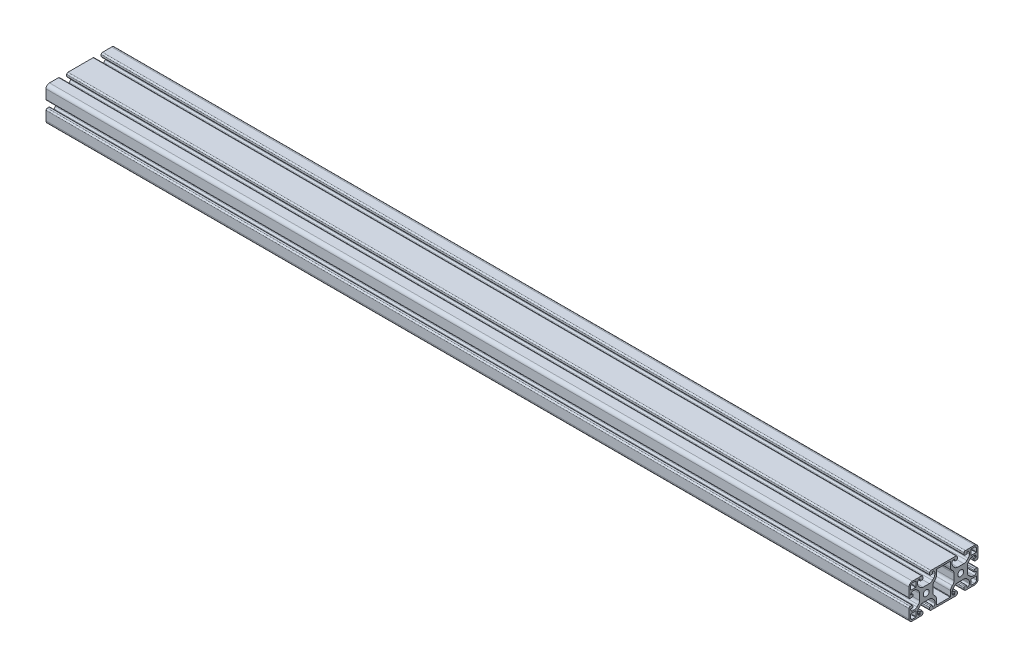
from build123d import *

# Parameters (mm, degrees)
MODEL_R                = 3.4
STRUKTURBAUTEIL1_DEPTH = 1000


with BuildPart() as part:
    # Model → Strukturbauteil1 (new body)
    with BuildSketch(Plane(origin=(0, 0, 0), x_dir=(0, 0, -1), z_dir=(1, 0, 0))):
        with BuildLine():
            Line((-39.999999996, -15.999999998), (-39.999999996, -5.499999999))
            ThreePointArc((-39.999999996, -5.499999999), (-39.560660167, -4.439339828), (-38.499999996, -4))
            Line((-38.499999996, -4), (-36.499999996, -4))
            ThreePointArc((-36.499999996, -4), (-35.792893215, -4.292893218), (-35.499999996, -4.999999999))
            Line((-35.499999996, -4.999999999), (-35.499999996, -6.499999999))
            ThreePointArc((-35.499999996, -6.499999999), (-35.646446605, -6.85355339), (-35.999999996, -6.999999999))
            Line((-35.999999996, -6.999999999), (-37.499999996, -6.999999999))
            Line((-37.499999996, -6.999999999), (-37.691341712, -7.038060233))
            Line((-37.691341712, -7.038060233), (-37.853553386, -7.146446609))
            Line((-37.853553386, -7.146446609), (-37.961939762, -7.308658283))
            Line((-37.961939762, -7.308658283), (-37.999999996, -7.499999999))
            ThreePointArc((-37.999999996, -7.499999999), (-37.267766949, -9.267766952), (-35.499999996, -9.999999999))
            Line((-35.499999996, -9.999999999), (-34.192388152, -9.999999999))
            ThreePointArc((-34.192388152, -9.999999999), (-32.27897099, -9.619397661), (-30.656854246, -8.535533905))
            Line((-30.656854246, -8.535533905), (-29.214466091, -7.09314575))
            ThreePointArc((-29.214466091, -7.09314575), (-28.130602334, -5.471029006), (-27.749999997, -3.557611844))
            Line((-27.749999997, -3.557611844), (-27.749999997, 3.557611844))
            ThreePointArc((-27.749999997, 3.557611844), (-28.130602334, 5.471029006), (-29.214466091, 7.09314575))
            Line((-29.214466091, 7.09314575), (-30.656854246, 8.535533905))
            ThreePointArc((-30.656854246, 8.535533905), (-32.27897099, 9.619397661), (-34.192388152, 9.999999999))
            Line((-34.192388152, 9.999999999), (-35.499999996, 9.999999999))
            ThreePointArc((-35.499999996, 9.999999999), (-37.267766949, 9.267766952), (-37.999999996, 7.499999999))
            Line((-37.999999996, 7.499999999), (-37.961939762, 7.308658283))
            Line((-37.961939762, 7.308658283), (-37.853553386, 7.146446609))
            Line((-37.853553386, 7.146446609), (-37.691341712, 7.038060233))
            Line((-37.691341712, 7.038060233), (-37.499999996, 6.999999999))
            Line((-37.499999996, 6.999999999), (-35.999999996, 6.999999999))
            ThreePointArc((-35.999999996, 6.999999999), (-35.646446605, 6.85355339), (-35.499999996, 6.499999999))
            Line((-35.499999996, 6.499999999), (-35.499999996, 4.999999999))
            ThreePointArc((-35.499999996, 4.999999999), (-35.792893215, 4.292893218), (-36.499999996, 4))
            Line((-36.499999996, 4), (-38.499999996, 4))
            ThreePointArc((-38.499999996, 4), (-39.560660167, 4.439339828), (-39.999999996, 5.499999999))
            Line((-39.999999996, 5.499999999), (-39.999999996, 15.999999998))
            ThreePointArc((-39.999999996, 15.999999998), (-38.82842712, 18.828427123), (-35.999999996, 19.999999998))
            Line((-35.999999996, 19.999999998), (-25.499999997, 19.999999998))
            ThreePointArc((-25.499999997, 19.999999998), (-24.439339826, 19.56066017), (-23.999999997, 18.499999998))
            Line((-23.999999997, 18.499999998), (-23.999999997, 16.499999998))
            ThreePointArc((-23.999999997, 16.499999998), (-24.292893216, 15.792893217), (-24.999999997, 15.499999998))
            Line((-24.999999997, 15.499999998), (-26.499999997, 15.499999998))
            ThreePointArc((-26.499999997, 15.499999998), (-26.853553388, 15.646446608), (-26.999999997, 15.999999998))
            Line((-26.999999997, 15.999999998), (-26.999999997, 17.499999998))
            Line((-26.999999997, 17.499999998), (-27.038060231, 17.691341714))
            Line((-27.038060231, 17.691341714), (-27.146446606, 17.853553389))
            Line((-27.146446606, 17.853553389), (-27.308658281, 17.961939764))
            Line((-27.308658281, 17.961939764), (-27.499999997, 17.999999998))
            ThreePointArc((-27.499999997, 17.999999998), (-29.26776695, 17.267766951), (-29.999999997, 15.499999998))
            Line((-29.999999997, 15.499999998), (-29.999999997, 14.192388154))
            ThreePointArc((-29.999999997, 14.192388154), (-29.619397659, 12.278970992), (-28.535533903, 10.656854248))
            Line((-28.535533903, 10.656854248), (-27.093145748, 9.214466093))
            ThreePointArc((-27.093145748, 9.214466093), (-25.471029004, 8.130602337), (-23.557611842, 7.749999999))
            Line((-23.557611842, 7.749999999), (-16.442388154, 7.749999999))
            ThreePointArc((-16.442388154, 7.749999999), (-14.528970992, 8.130602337), (-12.906854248, 9.214466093))
            Line((-12.906854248, 9.214466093), (-11.464466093, 10.656854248))
            ThreePointArc((-11.464466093, 10.656854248), (-10.380602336, 12.278970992), (-9.999999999, 14.192388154))
            Line((-9.999999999, 14.192388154), (-9.999999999, 15.499999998))
            ThreePointArc((-9.999999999, 15.499999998), (-10.732233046, 17.267766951), (-12.499999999, 17.999999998))
            Line((-12.499999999, 17.999999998), (-12.691341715, 17.961939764))
            Line((-12.691341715, 17.961939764), (-12.853553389, 17.853553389))
            Line((-12.853553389, 17.853553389), (-12.961939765, 17.691341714))
            Line((-12.961939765, 17.691341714), (-12.999999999, 17.499999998))
            Line((-12.999999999, 17.499999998), (-12.999999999, 15.999999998))
            ThreePointArc((-12.999999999, 15.999999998), (-13.146446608, 15.646446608), (-13.499999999, 15.499999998))
            Line((-13.499999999, 15.499999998), (-14.999999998, 15.499999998))
            ThreePointArc((-14.999999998, 15.499999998), (-15.707106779, 15.792893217), (-15.999999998, 16.499999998))
            Line((-15.999999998, 16.499999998), (-15.999999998, 18.499999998))
            ThreePointArc((-15.999999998, 18.499999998), (-15.56066017, 19.56066017), (-14.499999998, 19.999999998))
            Line((-14.499999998, 19.999999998), (14.499999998, 19.999999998))
            ThreePointArc((14.499999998, 19.999999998), (15.56066017, 19.56066017), (15.999999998, 18.499999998))
            Line((15.999999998, 18.499999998), (15.999999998, 16.499999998))
            ThreePointArc((15.999999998, 16.499999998), (15.707106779, 15.792893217), (14.999999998, 15.499999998))
            Line((14.999999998, 15.499999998), (13.499999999, 15.499999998))
            ThreePointArc((13.499999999, 15.499999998), (13.146446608, 15.646446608), (12.999999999, 15.999999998))
            Line((12.999999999, 15.999999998), (12.999999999, 17.499999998))
            Line((12.999999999, 17.499999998), (12.961939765, 17.691341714))
            Line((12.961939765, 17.691341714), (12.853553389, 17.853553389))
            Line((12.853553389, 17.853553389), (12.691341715, 17.961939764))
            Line((12.691341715, 17.961939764), (12.499999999, 17.999999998))
            ThreePointArc((12.499999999, 17.999999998), (10.732233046, 17.267766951), (9.999999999, 15.499999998))
            Line((9.999999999, 15.499999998), (9.999999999, 14.192388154))
            ThreePointArc((9.999999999, 14.192388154), (10.380602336, 12.278970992), (11.464466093, 10.656854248))
            Line((11.464466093, 10.656854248), (12.906854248, 9.214466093))
            ThreePointArc((12.906854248, 9.214466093), (14.528970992, 8.130602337), (16.442388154, 7.749999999))
            Line((16.442388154, 7.749999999), (23.557611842, 7.749999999))
            ThreePointArc((23.557611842, 7.749999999), (25.471029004, 8.130602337), (27.093145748, 9.214466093))
            Line((27.093145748, 9.214466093), (28.535533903, 10.656854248))
            ThreePointArc((28.535533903, 10.656854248), (29.619397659, 12.278970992), (29.999999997, 14.192388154))
            Line((29.999999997, 14.192388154), (29.999999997, 15.499999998))
            ThreePointArc((29.999999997, 15.499999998), (29.26776695, 17.267766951), (27.499999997, 17.999999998))
            Line((27.499999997, 17.999999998), (27.308658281, 17.961939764))
            Line((27.308658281, 17.961939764), (27.146446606, 17.853553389))
            Line((27.146446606, 17.853553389), (27.038060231, 17.691341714))
            Line((27.038060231, 17.691341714), (26.999999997, 17.499999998))
            Line((26.999999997, 17.499999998), (26.999999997, 15.999999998))
            ThreePointArc((26.999999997, 15.999999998), (26.853553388, 15.646446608), (26.499999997, 15.499999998))
            Line((26.499999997, 15.499999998), (24.999999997, 15.499999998))
            ThreePointArc((24.999999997, 15.499999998), (24.292893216, 15.792893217), (23.999999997, 16.499999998))
            Line((23.999999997, 16.499999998), (23.999999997, 18.499999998))
            ThreePointArc((23.999999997, 18.499999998), (24.439339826, 19.56066017), (25.499999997, 19.999999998))
            Line((25.499999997, 19.999999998), (35.999999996, 19.999999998))
            ThreePointArc((35.999999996, 19.999999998), (38.82842712, 18.828427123), (39.999999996, 15.999999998))
            Line((39.999999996, 15.999999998), (39.999999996, 5.499999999))
            ThreePointArc((39.999999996, 5.499999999), (39.560660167, 4.439339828), (38.499999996, 4))
            Line((38.499999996, 4), (36.499999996, 4))
            ThreePointArc((36.499999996, 4), (35.792893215, 4.292893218), (35.499999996, 4.999999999))
            Line((35.499999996, 4.999999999), (35.499999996, 6.499999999))
            ThreePointArc((35.499999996, 6.499999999), (35.646446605, 6.85355339), (35.999999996, 6.999999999))
            Line((35.999999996, 6.999999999), (37.499999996, 6.999999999))
            Line((37.499999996, 6.999999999), (37.691341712, 7.038060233))
            Line((37.691341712, 7.038060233), (37.853553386, 7.146446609))
            Line((37.853553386, 7.146446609), (37.961939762, 7.308658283))
            Line((37.961939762, 7.308658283), (37.999999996, 7.499999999))
            ThreePointArc((37.999999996, 7.499999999), (37.267766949, 9.267766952), (35.499999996, 9.999999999))
            Line((35.499999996, 9.999999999), (34.192388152, 9.999999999))
            ThreePointArc((34.192388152, 9.999999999), (32.27897099, 9.619397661), (30.656854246, 8.535533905))
            Line((30.656854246, 8.535533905), (29.214466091, 7.09314575))
            ThreePointArc((29.214466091, 7.09314575), (28.130602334, 5.471029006), (27.749999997, 3.557611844))
            Line((27.749999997, 3.557611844), (27.749999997, -3.557611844))
            ThreePointArc((27.749999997, -3.557611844), (28.130602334, -5.471029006), (29.214466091, -7.09314575))
            Line((29.214466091, -7.09314575), (30.656854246, -8.535533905))
            ThreePointArc((30.656854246, -8.535533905), (32.27897099, -9.619397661), (34.192388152, -9.999999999))
            Line((34.192388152, -9.999999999), (35.499999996, -9.999999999))
            ThreePointArc((35.499999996, -9.999999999), (37.267766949, -9.267766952), (37.999999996, -7.499999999))
            Line((37.999999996, -7.499999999), (37.961939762, -7.308658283))
            Line((37.961939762, -7.308658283), (37.853553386, -7.146446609))
            Line((37.853553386, -7.146446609), (37.691341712, -7.038060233))
            Line((37.691341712, -7.038060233), (37.499999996, -6.999999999))
            Line((37.499999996, -6.999999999), (35.999999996, -6.999999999))
            ThreePointArc((35.999999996, -6.999999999), (35.646446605, -6.85355339), (35.499999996, -6.499999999))
            Line((35.499999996, -6.499999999), (35.499999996, -4.999999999))
            ThreePointArc((35.499999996, -4.999999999), (35.792893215, -4.292893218), (36.499999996, -4))
            Line((36.499999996, -4), (38.499999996, -4))
            ThreePointArc((38.499999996, -4), (39.560660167, -4.439339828), (39.999999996, -5.499999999))
            Line((39.999999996, -5.499999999), (39.999999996, -15.999999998))
            ThreePointArc((39.999999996, -15.999999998), (38.82842712, -18.828427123), (35.999999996, -19.999999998))
            Line((35.999999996, -19.999999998), (25.499999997, -19.999999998))
            ThreePointArc((25.499999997, -19.999999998), (24.439339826, -19.56066017), (23.999999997, -18.499999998))
            Line((23.999999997, -18.499999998), (23.999999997, -16.499999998))
            ThreePointArc((23.999999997, -16.499999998), (24.292893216, -15.792893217), (24.999999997, -15.499999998))
            Line((24.999999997, -15.499999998), (26.499999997, -15.499999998))
            ThreePointArc((26.499999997, -15.499999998), (26.853553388, -15.646446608), (26.999999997, -15.999999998))
            Line((26.999999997, -15.999999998), (26.999999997, -17.499999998))
            Line((26.999999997, -17.499999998), (27.038060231, -17.691341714))
            Line((27.038060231, -17.691341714), (27.146446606, -17.853553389))
            Line((27.146446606, -17.853553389), (27.308658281, -17.961939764))
            Line((27.308658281, -17.961939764), (27.499999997, -17.999999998))
            ThreePointArc((27.499999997, -17.999999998), (29.26776695, -17.267766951), (29.999999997, -15.499999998))
            Line((29.999999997, -15.499999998), (29.999999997, -14.192388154))
            ThreePointArc((29.999999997, -14.192388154), (29.619397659, -12.278970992), (28.535533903, -10.656854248))
            Line((28.535533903, -10.656854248), (27.093145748, -9.214466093))
            ThreePointArc((27.093145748, -9.214466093), (25.471029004, -8.130602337), (23.557611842, -7.749999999))
            Line((23.557611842, -7.749999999), (16.442388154, -7.749999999))
            ThreePointArc((16.442388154, -7.749999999), (14.528970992, -8.130602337), (12.906854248, -9.214466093))
            Line((12.906854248, -9.214466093), (11.464466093, -10.656854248))
            ThreePointArc((11.464466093, -10.656854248), (10.380602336, -12.278970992), (9.999999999, -14.192388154))
            Line((9.999999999, -14.192388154), (9.999999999, -15.499999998))
            ThreePointArc((9.999999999, -15.499999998), (10.732233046, -17.267766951), (12.499999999, -17.999999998))
            Line((12.499999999, -17.999999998), (12.691341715, -17.961939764))
            Line((12.691341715, -17.961939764), (12.853553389, -17.853553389))
            Line((12.853553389, -17.853553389), (12.961939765, -17.691341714))
            Line((12.961939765, -17.691341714), (12.999999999, -17.499999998))
            Line((12.999999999, -17.499999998), (12.999999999, -15.999999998))
            ThreePointArc((12.999999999, -15.999999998), (13.146446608, -15.646446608), (13.499999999, -15.499999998))
            Line((13.499999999, -15.499999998), (14.999999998, -15.499999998))
            ThreePointArc((14.999999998, -15.499999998), (15.707106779, -15.792893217), (15.999999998, -16.499999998))
            Line((15.999999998, -16.499999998), (15.999999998, -18.499999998))
            ThreePointArc((15.999999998, -18.499999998), (15.56066017, -19.56066017), (14.499999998, -19.999999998))
            Line((14.499999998, -19.999999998), (-14.499999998, -19.999999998))
            ThreePointArc((-14.499999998, -19.999999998), (-15.56066017, -19.56066017), (-15.999999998, -18.499999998))
            Line((-15.999999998, -18.499999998), (-15.999999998, -16.499999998))
            ThreePointArc((-15.999999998, -16.499999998), (-15.707106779, -15.792893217), (-14.999999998, -15.499999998))
            Line((-14.999999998, -15.499999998), (-13.499999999, -15.499999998))
            ThreePointArc((-13.499999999, -15.499999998), (-13.146446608, -15.646446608), (-12.999999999, -15.999999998))
            Line((-12.999999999, -15.999999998), (-12.999999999, -17.499999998))
            Line((-12.999999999, -17.499999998), (-12.961939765, -17.691341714))
            Line((-12.961939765, -17.691341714), (-12.853553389, -17.853553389))
            Line((-12.853553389, -17.853553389), (-12.691341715, -17.961939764))
            Line((-12.691341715, -17.961939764), (-12.499999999, -17.999999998))
            ThreePointArc((-12.499999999, -17.999999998), (-10.732233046, -17.267766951), (-9.999999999, -15.499999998))
            Line((-9.999999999, -15.499999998), (-9.999999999, -14.192388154))
            ThreePointArc((-9.999999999, -14.192388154), (-10.380602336, -12.278970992), (-11.464466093, -10.656854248))
            Line((-11.464466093, -10.656854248), (-12.906854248, -9.214466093))
            ThreePointArc((-12.906854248, -9.214466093), (-14.528970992, -8.130602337), (-16.442388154, -7.749999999))
            Line((-16.442388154, -7.749999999), (-23.557611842, -7.749999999))
            ThreePointArc((-23.557611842, -7.749999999), (-25.471029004, -8.130602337), (-27.093145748, -9.214466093))
            Line((-27.093145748, -9.214466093), (-28.535533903, -10.656854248))
            ThreePointArc((-28.535533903, -10.656854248), (-29.619397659, -12.278970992), (-29.999999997, -14.192388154))
            Line((-29.999999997, -14.192388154), (-29.999999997, -15.499999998))
            ThreePointArc((-29.999999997, -15.499999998), (-29.26776695, -17.267766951), (-27.499999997, -17.999999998))
            Line((-27.499999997, -17.999999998), (-27.308658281, -17.961939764))
            Line((-27.308658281, -17.961939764), (-27.146446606, -17.853553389))
            Line((-27.146446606, -17.853553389), (-27.038060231, -17.691341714))
            Line((-27.038060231, -17.691341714), (-26.999999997, -17.499999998))
            Line((-26.999999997, -17.499999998), (-26.999999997, -15.999999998))
            ThreePointArc((-26.999999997, -15.999999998), (-26.853553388, -15.646446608), (-26.499999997, -15.499999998))
            Line((-26.499999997, -15.499999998), (-24.999999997, -15.499999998))
            ThreePointArc((-24.999999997, -15.499999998), (-24.292893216, -15.792893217), (-23.999999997, -16.499999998))
            Line((-23.999999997, -16.499999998), (-23.999999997, -18.499999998))
            ThreePointArc((-23.999999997, -18.499999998), (-24.439339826, -19.56066017), (-25.499999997, -19.999999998))
            Line((-25.499999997, -19.999999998), (-35.999999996, -19.999999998))
            ThreePointArc((-35.999999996, -19.999999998), (-38.82842712, -18.828427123), (-39.999999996, -15.999999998))
        make_face()
        with Locations((-19.999999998, 0)):
            Circle(MODEL_R, mode=Mode.SUBTRACT)
        with Locations((19.999999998, 0)):
            Circle(MODEL_R, mode=Mode.SUBTRACT)
        with BuildLine():
            Line((-38.199999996, 15.999999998), (-38.199999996, 12.299999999))
            ThreePointArc((-38.199999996, 12.299999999), (-38.053553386, 11.946446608), (-37.699999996, 11.799999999))
            Line((-37.699999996, 11.799999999), (-32.299999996, 11.799999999))
            ThreePointArc((-32.299999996, 11.799999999), (-31.946446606, 11.946446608), (-31.799999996, 12.299999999))
            Line((-31.799999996, 12.299999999), (-31.799999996, 17.699999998))
            ThreePointArc((-31.799999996, 17.699999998), (-31.946446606, 18.053553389), (-32.299999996, 18.199999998))
            Line((-32.299999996, 18.199999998), (-35.999999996, 18.199999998))
            ThreePointArc((-35.999999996, 18.199999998), (-37.555634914, 17.555634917), (-38.199999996, 15.999999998))
        make_face(mode=Mode.SUBTRACT)
        with BuildLine():
            Line((-35.999999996, -18.199999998), (-32.299999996, -18.199999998))
            ThreePointArc((-32.299999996, -18.199999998), (-31.946446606, -18.053553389), (-31.799999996, -17.699999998))
            Line((-31.799999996, -17.699999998), (-31.799999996, -12.299999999))
            ThreePointArc((-31.799999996, -12.299999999), (-31.946446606, -11.946446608), (-32.299999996, -11.799999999))
            Line((-32.299999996, -11.799999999), (-37.699999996, -11.799999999))
            ThreePointArc((-37.699999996, -11.799999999), (-38.053553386, -11.946446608), (-38.199999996, -12.299999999))
            Line((-38.199999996, -12.299999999), (-38.199999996, -15.999999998))
            ThreePointArc((-38.199999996, -15.999999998), (-37.555634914, -17.555634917), (-35.999999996, -18.199999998))
        make_face(mode=Mode.SUBTRACT)
        with BuildLine():
            Line((38.199999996, 12.299999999), (38.199999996, 15.999999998))
            ThreePointArc((38.199999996, 15.999999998), (37.555634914, 17.555634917), (35.999999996, 18.199999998))
            Line((35.999999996, 18.199999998), (32.299999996, 18.199999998))
            ThreePointArc((32.299999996, 18.199999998), (31.946446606, 18.053553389), (31.799999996, 17.699999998))
            Line((31.799999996, 17.699999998), (31.799999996, 12.299999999))
            ThreePointArc((31.799999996, 12.299999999), (31.946446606, 11.946446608), (32.299999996, 11.799999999))
            Line((32.299999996, 11.799999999), (37.699999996, 11.799999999))
            ThreePointArc((37.699999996, 11.799999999), (38.053553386, 11.946446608), (38.199999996, 12.299999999))
        make_face(mode=Mode.SUBTRACT)
        with BuildLine():
            Line((38.199999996, -15.999999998), (38.199999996, -12.299999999))
            ThreePointArc((38.199999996, -12.299999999), (38.053553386, -11.946446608), (37.699999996, -11.799999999))
            Line((37.699999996, -11.799999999), (32.299999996, -11.799999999))
            ThreePointArc((32.299999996, -11.799999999), (31.946446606, -11.946446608), (31.799999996, -12.299999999))
            Line((31.799999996, -12.299999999), (31.799999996, -17.699999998))
            ThreePointArc((31.799999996, -17.699999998), (31.946446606, -18.053553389), (32.299999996, -18.199999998))
            Line((32.299999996, -18.199999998), (35.999999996, -18.199999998))
            ThreePointArc((35.999999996, -18.199999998), (37.555634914, -17.555634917), (38.199999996, -15.999999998))
        make_face(mode=Mode.SUBTRACT)
        with BuildLine():
            Line((-12.249999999, 3.557611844), (-12.249999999, -3.557611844))
            ThreePointArc((-12.249999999, -3.557611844), (-11.727593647, -5.782730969), (-10.26953795, -7.542883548))
            Line((-10.26953795, -7.542883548), (-10.180462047, -7.609597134))
            ThreePointArc((-10.180462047, -7.609597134), (-8.722406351, -9.369749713), (-8.199999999, -11.594868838))
            Line((-8.199999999, -11.594868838), (-8.199999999, -17.499999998))
            ThreePointArc((-8.199999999, -17.499999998), (-8.05355339, -17.853553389), (-7.699999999, -17.999999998))
            Line((-7.699999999, -17.999999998), (7.699999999, -17.999999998))
            ThreePointArc((7.699999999, -17.999999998), (8.05355339, -17.853553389), (8.199999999, -17.499999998))
            Line((8.199999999, -17.499999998), (8.199999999, -11.594868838))
            ThreePointArc((8.199999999, -11.594868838), (8.722406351, -9.369749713), (10.180462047, -7.609597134))
            Line((10.180462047, -7.609597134), (10.26953795, -7.542883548))
            ThreePointArc((10.26953795, -7.542883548), (11.727593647, -5.782730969), (12.249999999, -3.557611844))
            Line((12.249999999, -3.557611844), (12.249999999, 3.557611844))
            ThreePointArc((12.249999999, 3.557611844), (11.727593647, 5.782730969), (10.26953795, 7.542883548))
            Line((10.26953795, 7.542883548), (10.180462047, 7.609597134))
            ThreePointArc((10.180462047, 7.609597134), (8.722406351, 9.369749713), (8.199999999, 11.594868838))
            Line((8.199999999, 11.594868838), (8.199999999, 17.499999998))
            ThreePointArc((8.199999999, 17.499999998), (8.05355339, 17.853553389), (7.699999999, 17.999999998))
            Line((7.699999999, 17.999999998), (-7.699999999, 17.999999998))
            ThreePointArc((-7.699999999, 17.999999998), (-8.05355339, 17.853553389), (-8.199999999, 17.499999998))
            Line((-8.199999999, 17.499999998), (-8.199999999, 11.594868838))
            ThreePointArc((-8.199999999, 11.594868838), (-8.722406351, 9.369749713), (-10.180462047, 7.609597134))
            Line((-10.180462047, 7.609597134), (-10.26953795, 7.542883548))
            ThreePointArc((-10.26953795, 7.542883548), (-11.727593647, 5.782730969), (-12.249999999, 3.557611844))
        make_face(mode=Mode.SUBTRACT)
    extrude(amount=STRUKTURBAUTEIL1_DEPTH)


solid = part.part
